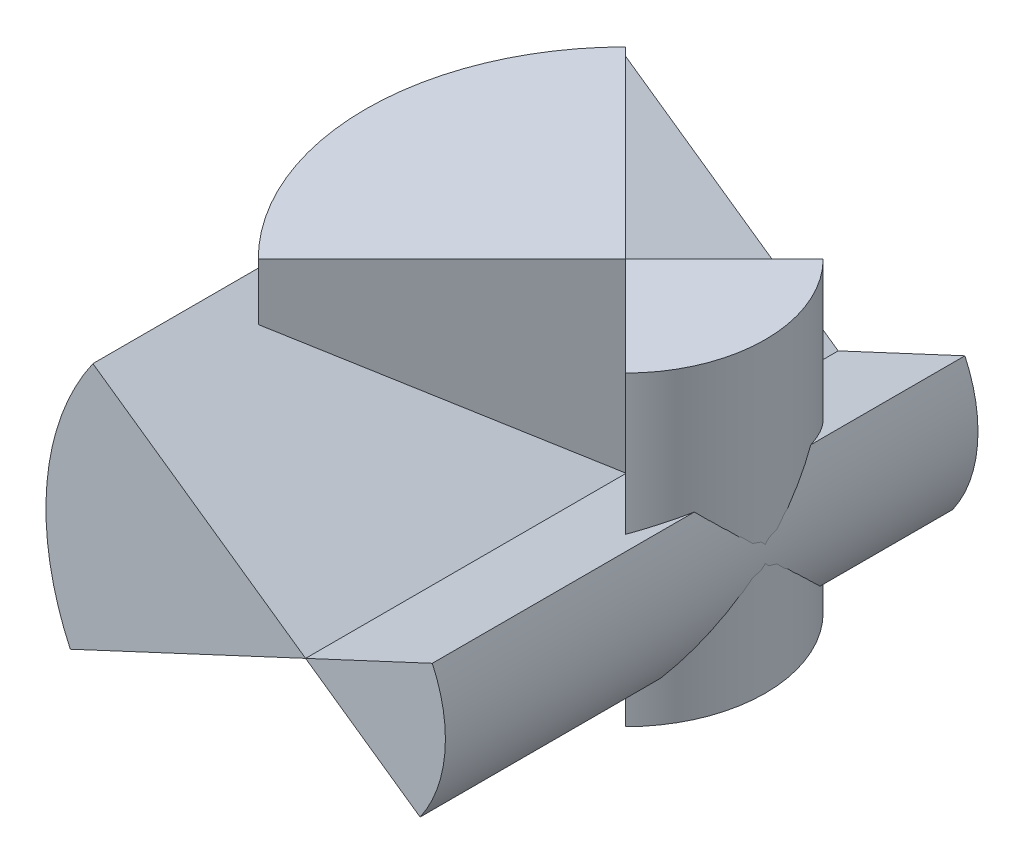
ISO-10303-21;
HEADER;
FILE_DESCRIPTION(('STEP AP214'),'2;1');
FILE_NAME('part.step','',(''),(''),'','','');
FILE_SCHEMA(('AUTOMOTIVE_DESIGN { 1 0 10303 214 1 1 1 1 }'));
ENDSEC;
DATA;
#1=APPLICATION_CONTEXT('core data for automotive mechanical design processes');
#2=APPLICATION_PROTOCOL_DEFINITION('international standard','automotive_design',2000,#1);
#3=PRODUCT_CONTEXT('',#1,'mechanical');
#4=PRODUCT('Part','Part','',(#3));
#5=PRODUCT_RELATED_PRODUCT_CATEGORY('part','',(#4));
#6=PRODUCT_DEFINITION_FORMATION('','',#4);
#7=PRODUCT_DEFINITION_CONTEXT('part definition',#1,'design');
#8=PRODUCT_DEFINITION('design','',#6,#7);
#9=PRODUCT_DEFINITION_SHAPE('','',#8);
#10=(LENGTH_UNIT() NAMED_UNIT(*) SI_UNIT(.MILLI.,.METRE.));
#11=(NAMED_UNIT(*) PLANE_ANGLE_UNIT() SI_UNIT($,.RADIAN.));
#12=(NAMED_UNIT(*) SI_UNIT($,.STERADIAN.) SOLID_ANGLE_UNIT());
#13=UNCERTAINTY_MEASURE_WITH_UNIT(LENGTH_MEASURE(1.E-05),#10,'distance_accuracy_value','');
#14=(GEOMETRIC_REPRESENTATION_CONTEXT(3) GLOBAL_UNCERTAINTY_ASSIGNED_CONTEXT((#13)) GLOBAL_UNIT_ASSIGNED_CONTEXT((#10,
#11,#12)) REPRESENTATION_CONTEXT('',''));
#15=CARTESIAN_POINT('',(0.,0.,0.));
#16=DIRECTION('',(0.,0.,1.));
#17=DIRECTION('',(1.,0.,0.));
#18=AXIS2_PLACEMENT_3D('',#15,#16,#17);
#19=CARTESIAN_POINT('',(0.,0.,200.));
#20=DIRECTION('',(0.422618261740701,-0.906307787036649,0.));
#21=DIRECTION('',(0.906307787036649,0.422618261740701,0.));
#22=AXIS2_PLACEMENT_3D('',#19,#20,#21);
#23=PLANE('',#22);
#24=DIRECTION('',(-0.906307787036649,-0.422618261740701,0.));
#25=VECTOR('',#24,1.);
#26=CARTESIAN_POINT('',(0.,0.,-200.));
#27=LINE('',#26,#25);
#28=CARTESIAN_POINT('',(0.,0.,-200.));
#29=VERTEX_POINT('',#28);
#30=CARTESIAN_POINT('',(-176.730018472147,-82.4105610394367,-200.));
#31=VERTEX_POINT('',#30);
#32=EDGE_CURVE('E13',#29,#31,#27,.T.);
#33=ORIENTED_EDGE('',*,*,#32,.F.);
#34=DIRECTION('',(0.,0.,-1.));
#35=VECTOR('',#34,1.);
#36=CARTESIAN_POINT('',(0.,0.,200.));
#37=LINE('',#36,#35);
#38=CARTESIAN_POINT('',(0.,0.,200.));
#39=VERTEX_POINT('',#38);
#40=EDGE_CURVE('E86',#39,#29,#37,.T.);
#41=ORIENTED_EDGE('',*,*,#40,.F.);
#42=DIRECTION('',(-0.906307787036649,-0.422618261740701,0.));
#43=VECTOR('',#42,1.);
#44=CARTESIAN_POINT('',(0.,0.,200.));
#45=LINE('',#44,#43);
#46=CARTESIAN_POINT('',(-176.730018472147,-82.4105610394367,200.));
#47=VERTEX_POINT('',#46);
#48=EDGE_CURVE('E116',#39,#47,#45,.T.);
#49=ORIENTED_EDGE('',*,*,#48,.T.);
#50=DIRECTION('',(0.,0.,-1.));
#51=VECTOR('',#50,1.);
#52=CARTESIAN_POINT('',(-176.730018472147,-82.4105610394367,200.));
#53=LINE('',#52,#51);
#54=EDGE_CURVE('E101',#47,#31,#53,.T.);
#55=ORIENTED_EDGE('',*,*,#54,.T.);
#56=EDGE_LOOP('',(#33,#41,#49,#55));
#57=FACE_BOUND('',#56,.T.);
#58=ADVANCED_FACE('F82',(#57),#23,.T.);
#59=CARTESIAN_POINT('',(0.,0.,200.));
#60=DIRECTION('',(-0.573576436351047,-0.819152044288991,0.));
#61=DIRECTION('',(0.819152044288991,-0.573576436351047,0.));
#62=AXIS2_PLACEMENT_3D('',#59,#60,#61);
#63=PLANE('',#62);
#64=DIRECTION('',(-0.819152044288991,0.573576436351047,0.));
#65=VECTOR('',#64,1.);
#66=CARTESIAN_POINT('',(0.,0.,-200.));
#67=LINE('',#66,#65);
#68=CARTESIAN_POINT('',(-159.734648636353,111.847405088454,-200.));
#69=VERTEX_POINT('',#68);
#70=EDGE_CURVE('E123',#29,#69,#67,.T.);
#71=ORIENTED_EDGE('',*,*,#70,.T.);
#72=DIRECTION('',(0.,0.,-1.));
#73=VECTOR('',#72,1.);
#74=CARTESIAN_POINT('',(-159.734648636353,111.847405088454,200.));
#75=LINE('',#74,#73);
#76=CARTESIAN_POINT('',(-159.734648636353,111.847405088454,200.));
#77=VERTEX_POINT('',#76);
#78=EDGE_CURVE('E129',#77,#69,#75,.T.);
#79=ORIENTED_EDGE('',*,*,#78,.F.);
#80=DIRECTION('',(-0.819152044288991,0.573576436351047,0.));
#81=VECTOR('',#80,1.);
#82=CARTESIAN_POINT('',(0.,0.,200.));
#83=LINE('',#82,#81);
#84=EDGE_CURVE('E113',#39,#77,#83,.T.);
#85=ORIENTED_EDGE('',*,*,#84,.F.);
#86=ORIENTED_EDGE('',*,*,#40,.T.);
#87=EDGE_LOOP('',(#71,#79,#85,#86));
#88=FACE_BOUND('',#87,.T.);
#89=ADVANCED_FACE('F128',(#88),#63,.F.);
#90=CARTESIAN_POINT('',(0.,0.,200.));
#91=DIRECTION('',(0.,0.,-1.));
#92=DIRECTION('',(-1.,0.,0.));
#93=AXIS2_PLACEMENT_3D('',#90,#91,#92);
#94=CYLINDRICAL_SURFACE('',#93,195.);
#95=CARTESIAN_POINT('',(0.,0.,-200.));
#96=DIRECTION('',(0.,0.,1.));
#97=DIRECTION('',(1.,0.,0.));
#98=AXIS2_PLACEMENT_3D('',#95,#96,#97);
#99=CIRCLE('',#98,195.);
#100=EDGE_CURVE('E92',#69,#31,#99,.T.);
#101=ORIENTED_EDGE('',*,*,#100,.T.);
#102=ORIENTED_EDGE('',*,*,#54,.F.);
#103=CARTESIAN_POINT('',(0.,0.,200.));
#104=DIRECTION('',(0.,0.,1.));
#105=DIRECTION('',(1.,0.,0.));
#106=AXIS2_PLACEMENT_3D('',#103,#104,#105);
#107=CIRCLE('',#106,195.);
#108=EDGE_CURVE('E137',#77,#47,#107,.T.);
#109=ORIENTED_EDGE('',*,*,#108,.F.);
#110=ORIENTED_EDGE('',*,*,#78,.T.);
#111=EDGE_LOOP('',(#101,#102,#109,#110));
#112=FACE_BOUND('',#111,.T.);
#113=ADVANCED_FACE('F138',(#112),#94,.T.);
#114=CARTESIAN_POINT('',(0.,0.,200.));
#115=DIRECTION('',(0.,0.,1.));
#116=DIRECTION('',(1.,0.,0.));
#117=AXIS2_PLACEMENT_3D('',#114,#115,#116);
#118=PLANE('',#117);
#119=ORIENTED_EDGE('',*,*,#48,.F.);
#120=ORIENTED_EDGE('',*,*,#84,.T.);
#121=ORIENTED_EDGE('',*,*,#108,.T.);
#122=EDGE_LOOP('',(#119,#120,#121));
#123=FACE_BOUND('',#122,.T.);
#124=ADVANCED_FACE('F84',(#123),#118,.T.);
#125=CARTESIAN_POINT('',(0.,0.,-200.));
#126=DIRECTION('',(0.,0.,1.));
#127=DIRECTION('',(1.,0.,0.));
#128=AXIS2_PLACEMENT_3D('',#125,#126,#127);
#129=PLANE('',#128);
#130=ORIENTED_EDGE('',*,*,#32,.T.);
#131=ORIENTED_EDGE('',*,*,#100,.F.);
#132=ORIENTED_EDGE('',*,*,#70,.F.);
#133=EDGE_LOOP('',(#130,#131,#132));
#134=FACE_BOUND('',#133,.T.);
#135=ADVANCED_FACE('F124',(#134),#129,.F.);
#136=CLOSED_SHELL('',(#58,#89,#113,#124,#135));
#137=MANIFOLD_SOLID_BREP('B2',#136);
#138=CARTESIAN_POINT('',(0.,0.,200.));
#139=DIRECTION('',(0.573576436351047,0.819152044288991,0.));
#140=DIRECTION('',(-0.819152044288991,0.573576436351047,0.));
#141=AXIS2_PLACEMENT_3D('',#138,#139,#140);
#142=PLANE('',#141);
#143=DIRECTION('',(0.819152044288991,-0.573576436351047,0.));
#144=VECTOR('',#143,1.);
#145=CARTESIAN_POINT('',(0.,0.,-200.));
#146=LINE('',#145,#144);
#147=CARTESIAN_POINT('',(0.,0.,-200.));
#148=VERTEX_POINT('',#147);
#149=CARTESIAN_POINT('',(86.010964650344,-60.2255258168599,-200.));
#150=VERTEX_POINT('',#149);
#151=EDGE_CURVE('E232',#148,#150,#146,.T.);
#152=ORIENTED_EDGE('',*,*,#151,.T.);
#153=DIRECTION('',(0.,0.,-1.));
#154=VECTOR('',#153,1.);
#155=CARTESIAN_POINT('',(86.010964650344,-60.2255258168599,200.));
#156=LINE('',#155,#154);
#157=CARTESIAN_POINT('',(86.010964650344,-60.2255258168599,200.));
#158=VERTEX_POINT('',#157);
#159=EDGE_CURVE('E193',#158,#150,#156,.T.);
#160=ORIENTED_EDGE('',*,*,#159,.F.);
#161=DIRECTION('',(0.819152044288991,-0.573576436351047,0.));
#162=VECTOR('',#161,1.);
#163=CARTESIAN_POINT('',(0.,0.,200.));
#164=LINE('',#163,#162);
#165=CARTESIAN_POINT('',(0.,0.,200.));
#166=VERTEX_POINT('',#165);
#167=EDGE_CURVE('E235',#166,#158,#164,.T.);
#168=ORIENTED_EDGE('',*,*,#167,.F.);
#169=DIRECTION('',(0.,0.,-1.));
#170=VECTOR('',#169,1.);
#171=CARTESIAN_POINT('',(0.,0.,200.));
#172=LINE('',#171,#170);
#173=EDGE_CURVE('E80',#166,#148,#172,.T.);
#174=ORIENTED_EDGE('',*,*,#173,.T.);
#175=EDGE_LOOP('',(#152,#160,#168,#174));
#176=FACE_BOUND('',#175,.T.);
#177=ADVANCED_FACE('F190',(#176),#142,.F.);
#178=CARTESIAN_POINT('',(0.,0.,200.));
#179=DIRECTION('',(0.,0.,-1.));
#180=DIRECTION('',(-1.,0.,0.));
#181=AXIS2_PLACEMENT_3D('',#178,#179,#180);
#182=CYLINDRICAL_SURFACE('',#181,105.);
#183=CARTESIAN_POINT('',(0.,0.,-200.));
#184=DIRECTION('',(0.,0.,1.));
#185=DIRECTION('',(1.,0.,0.));
#186=AXIS2_PLACEMENT_3D('',#183,#184,#185);
#187=CIRCLE('',#186,105.);
#188=CARTESIAN_POINT('',(95.1623176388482,44.3749174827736,-200.));
#189=VERTEX_POINT('',#188);
#190=EDGE_CURVE('E220',#150,#189,#187,.T.);
#191=ORIENTED_EDGE('',*,*,#190,.T.);
#192=DIRECTION('',(0.,0.,-1.));
#193=VECTOR('',#192,1.);
#194=CARTESIAN_POINT('',(95.1623176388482,44.3749174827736,200.));
#195=LINE('',#194,#193);
#196=CARTESIAN_POINT('',(95.1623176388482,44.3749174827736,200.));
#197=VERTEX_POINT('',#196);
#198=EDGE_CURVE('E224',#197,#189,#195,.T.);
#199=ORIENTED_EDGE('',*,*,#198,.F.);
#200=CARTESIAN_POINT('',(0.,0.,200.));
#201=DIRECTION('',(0.,0.,1.));
#202=DIRECTION('',(1.,0.,0.));
#203=AXIS2_PLACEMENT_3D('',#200,#201,#202);
#204=CIRCLE('',#203,105.);
#205=EDGE_CURVE('E238',#158,#197,#204,.T.);
#206=ORIENTED_EDGE('',*,*,#205,.F.);
#207=ORIENTED_EDGE('',*,*,#159,.T.);
#208=EDGE_LOOP('',(#191,#199,#206,#207));
#209=FACE_BOUND('',#208,.T.);
#210=ADVANCED_FACE('F229',(#209),#182,.T.);
#211=CARTESIAN_POINT('',(0.,0.,200.));
#212=DIRECTION('',(-0.422618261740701,0.906307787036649,0.));
#213=DIRECTION('',(-0.906307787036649,-0.422618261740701,0.));
#214=AXIS2_PLACEMENT_3D('',#211,#212,#213);
#215=PLANE('',#214);
#216=DIRECTION('',(0.906307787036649,0.422618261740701,0.));
#217=VECTOR('',#216,1.);
#218=CARTESIAN_POINT('',(0.,0.,-200.));
#219=LINE('',#218,#217);
#220=EDGE_CURVE('E226',#148,#189,#219,.T.);
#221=ORIENTED_EDGE('',*,*,#220,.F.);
#222=ORIENTED_EDGE('',*,*,#173,.F.);
#223=DIRECTION('',(0.906307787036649,0.422618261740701,0.));
#224=VECTOR('',#223,1.);
#225=CARTESIAN_POINT('',(0.,0.,200.));
#226=LINE('',#225,#224);
#227=EDGE_CURVE('E227',#166,#197,#226,.T.);
#228=ORIENTED_EDGE('',*,*,#227,.T.);
#229=ORIENTED_EDGE('',*,*,#198,.T.);
#230=EDGE_LOOP('',(#221,#222,#228,#229));
#231=FACE_BOUND('',#230,.T.);
#232=ADVANCED_FACE('F225',(#231),#215,.T.);
#233=CARTESIAN_POINT('',(0.,0.,200.));
#234=DIRECTION('',(0.,0.,1.));
#235=DIRECTION('',(1.,0.,0.));
#236=AXIS2_PLACEMENT_3D('',#233,#234,#235);
#237=PLANE('',#236);
#238=ORIENTED_EDGE('',*,*,#167,.T.);
#239=ORIENTED_EDGE('',*,*,#205,.T.);
#240=ORIENTED_EDGE('',*,*,#227,.F.);
#241=EDGE_LOOP('',(#238,#239,#240));
#242=FACE_BOUND('',#241,.T.);
#243=ADVANCED_FACE('F244',(#242),#237,.T.);
#244=CARTESIAN_POINT('',(0.,0.,-200.));
#245=DIRECTION('',(0.,0.,1.));
#246=DIRECTION('',(1.,0.,0.));
#247=AXIS2_PLACEMENT_3D('',#244,#245,#246);
#248=PLANE('',#247);
#249=ORIENTED_EDGE('',*,*,#151,.F.);
#250=ORIENTED_EDGE('',*,*,#220,.T.);
#251=ORIENTED_EDGE('',*,*,#190,.F.);
#252=EDGE_LOOP('',(#249,#250,#251));
#253=FACE_BOUND('',#252,.T.);
#254=ADVANCED_FACE('F234',(#253),#248,.F.);
#255=CLOSED_SHELL('',(#177,#210,#232,#243,#254));
#256=MANIFOLD_SOLID_BREP('B7',#255);
#257=CARTESIAN_POINT('',(-0.27291572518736,139.420227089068,-40.5));
#258=DIRECTION('',(0.707106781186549,0.,0.707106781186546));
#259=DIRECTION('',(0.707106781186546,0.,-0.707106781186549));
#260=AXIS2_PLACEMENT_3D('',#257,#258,#259);
#261=PLANE('',#260);
#262=DIRECTION('',(-0.707106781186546,0.,0.707106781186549));
#263=VECTOR('',#262,1.);
#264=CARTESIAN_POINT('',(-0.27291572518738,-90.5797729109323,-40.5));
#265=LINE('',#264,#263);
#266=CARTESIAN_POINT('',(-0.27291572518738,-90.5797729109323,-40.5));
#267=VERTEX_POINT('',#266);
#268=CARTESIAN_POINT('',(-138.158738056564,-90.5797729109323,97.3858223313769));
#269=VERTEX_POINT('',#268);
#270=EDGE_CURVE('E188',#267,#269,#265,.T.);
#271=ORIENTED_EDGE('',*,*,#270,.F.);
#272=DIRECTION('',(0.,-1.,0.));
#273=VECTOR('',#272,1.);
#274=CARTESIAN_POINT('',(-0.27291572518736,139.420227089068,-40.5));
#275=LINE('',#274,#273);
#276=CARTESIAN_POINT('',(-0.27291572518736,139.420227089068,-40.5));
#277=VERTEX_POINT('',#276);
#278=EDGE_CURVE('E301',#277,#267,#275,.T.);
#279=ORIENTED_EDGE('',*,*,#278,.F.);
#280=DIRECTION('',(-0.707106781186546,0.,0.707106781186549));
#281=VECTOR('',#280,1.);
#282=CARTESIAN_POINT('',(-0.27291572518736,139.420227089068,-40.5));
#283=LINE('',#282,#281);
#284=CARTESIAN_POINT('',(-138.158738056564,139.420227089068,97.385822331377));
#285=VERTEX_POINT('',#284);
#286=EDGE_CURVE('E331',#277,#285,#283,.T.);
#287=ORIENTED_EDGE('',*,*,#286,.T.);
#288=DIRECTION('',(0.,-1.,0.));
#289=VECTOR('',#288,1.);
#290=CARTESIAN_POINT('',(-138.158738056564,139.420227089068,97.385822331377));
#291=LINE('',#290,#289);
#292=EDGE_CURVE('E316',#285,#269,#291,.T.);
#293=ORIENTED_EDGE('',*,*,#292,.T.);
#294=EDGE_LOOP('',(#271,#279,#287,#293));
#295=FACE_BOUND('',#294,.T.);
#296=ADVANCED_FACE('F297',(#295),#261,.T.);
#297=CARTESIAN_POINT('',(-0.27291572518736,139.420227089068,-40.5));
#298=DIRECTION('',(-0.707106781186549,0.,0.707106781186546));
#299=DIRECTION('',(0.707106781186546,0.,0.707106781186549));
#300=AXIS2_PLACEMENT_3D('',#297,#298,#299);
#301=PLANE('',#300);
#302=DIRECTION('',(-0.707106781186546,0.,-0.707106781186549));
#303=VECTOR('',#302,1.);
#304=CARTESIAN_POINT('',(-0.27291572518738,-90.5797729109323,-40.5));
#305=LINE('',#304,#303);
#306=CARTESIAN_POINT('',(-138.158738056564,-90.5797729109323,-178.385822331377));
#307=VERTEX_POINT('',#306);
#308=EDGE_CURVE('E338',#267,#307,#305,.T.);
#309=ORIENTED_EDGE('',*,*,#308,.T.);
#310=DIRECTION('',(0.,-1.,0.));
#311=VECTOR('',#310,1.);
#312=CARTESIAN_POINT('',(-138.158738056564,139.420227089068,-178.385822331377));
#313=LINE('',#312,#311);
#314=CARTESIAN_POINT('',(-138.158738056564,139.420227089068,-178.385822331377));
#315=VERTEX_POINT('',#314);
#316=EDGE_CURVE('E344',#315,#307,#313,.T.);
#317=ORIENTED_EDGE('',*,*,#316,.F.);
#318=DIRECTION('',(-0.707106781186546,0.,-0.707106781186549));
#319=VECTOR('',#318,1.);
#320=CARTESIAN_POINT('',(-0.27291572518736,139.420227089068,-40.5));
#321=LINE('',#320,#319);
#322=EDGE_CURVE('E328',#277,#315,#321,.T.);
#323=ORIENTED_EDGE('',*,*,#322,.F.);
#324=ORIENTED_EDGE('',*,*,#278,.T.);
#325=EDGE_LOOP('',(#309,#317,#323,#324));
#326=FACE_BOUND('',#325,.T.);
#327=ADVANCED_FACE('F343',(#326),#301,.F.);
#328=CARTESIAN_POINT('',(-0.27291572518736,139.420227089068,-40.5));
#329=DIRECTION('',(0.,-1.,0.));
#330=DIRECTION('',(0.,0.,-1.));
#331=AXIS2_PLACEMENT_3D('',#328,#329,#330);
#332=CYLINDRICAL_SURFACE('',#331,195.);
#333=CARTESIAN_POINT('',(-0.27291572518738,-90.5797729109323,-40.5));
#334=DIRECTION('',(0.,1.,0.));
#335=DIRECTION('',(0.,0.,1.));
#336=AXIS2_PLACEMENT_3D('',#333,#334,#335);
#337=CIRCLE('',#336,195.);
#338=EDGE_CURVE('E307',#307,#269,#337,.T.);
#339=ORIENTED_EDGE('',*,*,#338,.T.);
#340=ORIENTED_EDGE('',*,*,#292,.F.);
#341=CARTESIAN_POINT('',(-0.27291572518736,139.420227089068,-40.5));
#342=DIRECTION('',(0.,1.,0.));
#343=DIRECTION('',(0.,0.,1.));
#344=AXIS2_PLACEMENT_3D('',#341,#342,#343);
#345=CIRCLE('',#344,195.);
#346=EDGE_CURVE('E352',#315,#285,#345,.T.);
#347=ORIENTED_EDGE('',*,*,#346,.F.);
#348=ORIENTED_EDGE('',*,*,#316,.T.);
#349=EDGE_LOOP('',(#339,#340,#347,#348));
#350=FACE_BOUND('',#349,.T.);
#351=ADVANCED_FACE('F353',(#350),#332,.T.);
#352=CARTESIAN_POINT('',(-0.27291572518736,139.420227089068,-40.5));
#353=DIRECTION('',(0.,1.,0.));
#354=DIRECTION('',(0.,0.,1.));
#355=AXIS2_PLACEMENT_3D('',#352,#353,#354);
#356=PLANE('',#355);
#357=ORIENTED_EDGE('',*,*,#286,.F.);
#358=ORIENTED_EDGE('',*,*,#322,.T.);
#359=ORIENTED_EDGE('',*,*,#346,.T.);
#360=EDGE_LOOP('',(#357,#358,#359));
#361=FACE_BOUND('',#360,.T.);
#362=ADVANCED_FACE('F299',(#361),#356,.T.);
#363=CARTESIAN_POINT('',(-0.27291572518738,-90.5797729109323,-40.5));
#364=DIRECTION('',(0.,1.,0.));
#365=DIRECTION('',(0.,0.,1.));
#366=AXIS2_PLACEMENT_3D('',#363,#364,#365);
#367=PLANE('',#366);
#368=ORIENTED_EDGE('',*,*,#270,.T.);
#369=ORIENTED_EDGE('',*,*,#338,.F.);
#370=ORIENTED_EDGE('',*,*,#308,.F.);
#371=EDGE_LOOP('',(#368,#369,#370));
#372=FACE_BOUND('',#371,.T.);
#373=ADVANCED_FACE('F339',(#372),#367,.F.);
#374=CLOSED_SHELL('',(#296,#327,#351,#362,#373));
#375=MANIFOLD_SOLID_BREP('B74',#374);
#376=CARTESIAN_POINT('',(-0.27291572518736,139.420227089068,-40.5));
#377=DIRECTION('',(-0.707106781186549,0.,-0.707106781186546));
#378=DIRECTION('',(-0.707106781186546,0.,0.707106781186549));
#379=AXIS2_PLACEMENT_3D('',#376,#377,#378);
#380=PLANE('',#379);
#381=DIRECTION('',(0.707106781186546,0.,-0.707106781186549));
#382=VECTOR('',#381,1.);
#383=CARTESIAN_POINT('',(-0.27291572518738,-90.5797729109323,-40.5));
#384=LINE('',#383,#382);
#385=CARTESIAN_POINT('',(-0.27291572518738,-90.5797729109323,-40.5));
#386=VERTEX_POINT('',#385);
#387=CARTESIAN_POINT('',(73.9732962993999,-90.5797729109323,-114.746212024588));
#388=VERTEX_POINT('',#387);
#389=EDGE_CURVE('E443',#386,#388,#384,.T.);
#390=ORIENTED_EDGE('',*,*,#389,.F.);
#391=DIRECTION('',(0.,-1.,0.));
#392=VECTOR('',#391,1.);
#393=CARTESIAN_POINT('',(-0.27291572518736,139.420227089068,-40.5));
#394=LINE('',#393,#392);
#395=CARTESIAN_POINT('',(-0.27291572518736,139.420227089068,-40.5));
#396=VERTEX_POINT('',#395);
#397=EDGE_CURVE('E295',#396,#386,#394,.T.);
#398=ORIENTED_EDGE('',*,*,#397,.F.);
#399=DIRECTION('',(0.707106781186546,0.,-0.707106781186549));
#400=VECTOR('',#399,1.);
#401=CARTESIAN_POINT('',(-0.27291572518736,139.420227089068,-40.5));
#402=LINE('',#401,#400);
#403=CARTESIAN_POINT('',(73.9732962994,139.420227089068,-114.746212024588));
#404=VERTEX_POINT('',#403);
#405=EDGE_CURVE('E436',#396,#404,#402,.T.);
#406=ORIENTED_EDGE('',*,*,#405,.T.);
#407=DIRECTION('',(0.,-1.,0.));
#408=VECTOR('',#407,1.);
#409=CARTESIAN_POINT('',(73.9732962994,139.420227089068,-114.746212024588));
#410=LINE('',#409,#408);
#411=EDGE_CURVE('E398',#404,#388,#410,.T.);
#412=ORIENTED_EDGE('',*,*,#411,.T.);
#413=EDGE_LOOP('',(#390,#398,#406,#412));
#414=FACE_BOUND('',#413,.T.);
#415=ADVANCED_FACE('F395',(#414),#380,.T.);
#416=CARTESIAN_POINT('',(-0.27291572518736,139.420227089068,-40.5));
#417=DIRECTION('',(0.707106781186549,0.,-0.707106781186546));
#418=DIRECTION('',(-0.707106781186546,0.,-0.707106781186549));
#419=AXIS2_PLACEMENT_3D('',#416,#417,#418);
#420=PLANE('',#419);
#421=DIRECTION('',(0.707106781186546,0.,0.707106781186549));
#422=VECTOR('',#421,1.);
#423=CARTESIAN_POINT('',(-0.27291572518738,-90.5797729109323,-40.5));
#424=LINE('',#423,#422);
#425=CARTESIAN_POINT('',(73.9732962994,-90.5797729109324,33.7462120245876));
#426=VERTEX_POINT('',#425);
#427=EDGE_CURVE('E428',#386,#426,#424,.T.);
#428=ORIENTED_EDGE('',*,*,#427,.T.);
#429=DIRECTION('',(0.,-1.,0.));
#430=VECTOR('',#429,1.);
#431=CARTESIAN_POINT('',(73.9732962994,139.420227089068,33.7462120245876));
#432=LINE('',#431,#430);
#433=CARTESIAN_POINT('',(73.9732962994,139.420227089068,33.7462120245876));
#434=VERTEX_POINT('',#433);
#435=EDGE_CURVE('E404',#434,#426,#432,.T.);
#436=ORIENTED_EDGE('',*,*,#435,.F.);
#437=DIRECTION('',(0.707106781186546,0.,0.707106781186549));
#438=VECTOR('',#437,1.);
#439=CARTESIAN_POINT('',(-0.27291572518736,139.420227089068,-40.5));
#440=LINE('',#439,#438);
#441=EDGE_CURVE('E447',#396,#434,#440,.T.);
#442=ORIENTED_EDGE('',*,*,#441,.F.);
#443=ORIENTED_EDGE('',*,*,#397,.T.);
#444=EDGE_LOOP('',(#428,#436,#442,#443));
#445=FACE_BOUND('',#444,.T.);
#446=ADVANCED_FACE('F430',(#445),#420,.F.);
#447=CARTESIAN_POINT('',(-0.27291572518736,139.420227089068,-40.5));
#448=DIRECTION('',(0.,-1.,0.));
#449=DIRECTION('',(0.,0.,-1.));
#450=AXIS2_PLACEMENT_3D('',#447,#448,#449);
#451=CYLINDRICAL_SURFACE('',#450,105.);
#452=CARTESIAN_POINT('',(-0.27291572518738,-90.5797729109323,-40.5));
#453=DIRECTION('',(0.,1.,0.));
#454=DIRECTION('',(0.,0.,1.));
#455=AXIS2_PLACEMENT_3D('',#452,#453,#454);
#456=CIRCLE('',#455,105.);
#457=EDGE_CURVE('E437',#426,#388,#456,.T.);
#458=ORIENTED_EDGE('',*,*,#457,.T.);
#459=ORIENTED_EDGE('',*,*,#411,.F.);
#460=CARTESIAN_POINT('',(-0.27291572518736,139.420227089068,-40.5));
#461=DIRECTION('',(0.,1.,0.));
#462=DIRECTION('',(0.,0.,1.));
#463=AXIS2_PLACEMENT_3D('',#460,#461,#462);
#464=CIRCLE('',#463,105.);
#465=EDGE_CURVE('E441',#434,#404,#464,.T.);
#466=ORIENTED_EDGE('',*,*,#465,.F.);
#467=ORIENTED_EDGE('',*,*,#435,.T.);
#468=EDGE_LOOP('',(#458,#459,#466,#467));
#469=FACE_BOUND('',#468,.T.);
#470=ADVANCED_FACE('F440',(#469),#451,.T.);
#471=CARTESIAN_POINT('',(-0.27291572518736,139.420227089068,-40.5));
#472=DIRECTION('',(0.,1.,0.));
#473=DIRECTION('',(0.,0.,1.));
#474=AXIS2_PLACEMENT_3D('',#471,#472,#473);
#475=PLANE('',#474);
#476=ORIENTED_EDGE('',*,*,#405,.F.);
#477=ORIENTED_EDGE('',*,*,#441,.T.);
#478=ORIENTED_EDGE('',*,*,#465,.T.);
#479=EDGE_LOOP('',(#476,#477,#478));
#480=FACE_BOUND('',#479,.T.);
#481=ADVANCED_FACE('F451',(#480),#475,.T.);
#482=CARTESIAN_POINT('',(-0.27291572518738,-90.5797729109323,-40.5));
#483=DIRECTION('',(0.,1.,0.));
#484=DIRECTION('',(0.,0.,1.));
#485=AXIS2_PLACEMENT_3D('',#482,#483,#484);
#486=PLANE('',#485);
#487=ORIENTED_EDGE('',*,*,#389,.T.);
#488=ORIENTED_EDGE('',*,*,#457,.F.);
#489=ORIENTED_EDGE('',*,*,#427,.F.);
#490=EDGE_LOOP('',(#487,#488,#489));
#491=FACE_BOUND('',#490,.T.);
#492=ADVANCED_FACE('F442',(#491),#486,.F.);
#493=CLOSED_SHELL('',(#415,#446,#470,#481,#492));
#494=MANIFOLD_SOLID_BREP('B182',#493);
#495=ADVANCED_BREP_SHAPE_REPRESENTATION('',(#18,#137,#256,#375,#494),#14);
#496=SHAPE_DEFINITION_REPRESENTATION(#9,#495);
ENDSEC;
END-ISO-10303-21;
